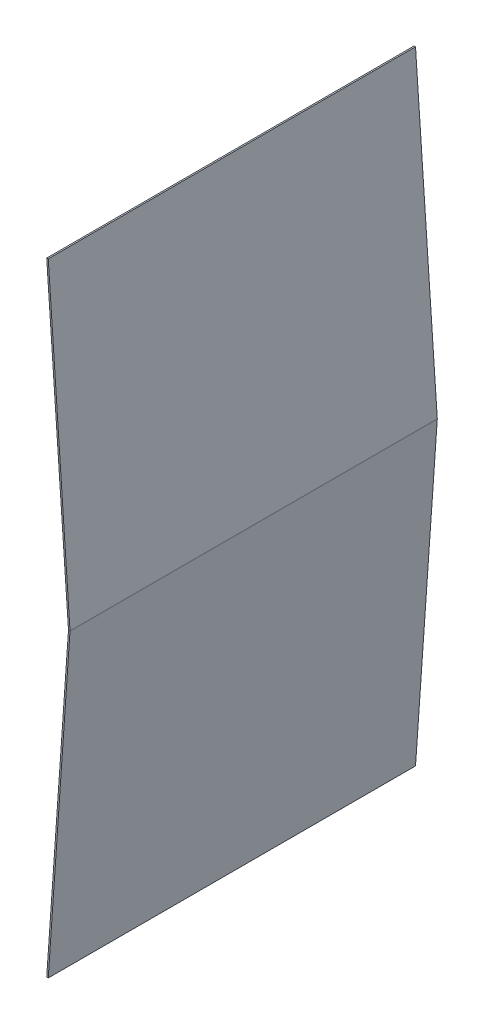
ISO-10303-21;
HEADER;
FILE_DESCRIPTION(('STEP AP214'),'2;1');
FILE_NAME('part.step','',(''),(''),'','','');
FILE_SCHEMA(('AUTOMOTIVE_DESIGN { 1 0 10303 214 1 1 1 1 }'));
ENDSEC;
DATA;
#1=APPLICATION_CONTEXT('core data for automotive mechanical design processes');
#2=APPLICATION_PROTOCOL_DEFINITION('international standard','automotive_design',2000,#1);
#3=PRODUCT_CONTEXT('',#1,'mechanical');
#4=PRODUCT('Part','Part','',(#3));
#5=PRODUCT_RELATED_PRODUCT_CATEGORY('part','',(#4));
#6=PRODUCT_DEFINITION_FORMATION('','',#4);
#7=PRODUCT_DEFINITION_CONTEXT('part definition',#1,'design');
#8=PRODUCT_DEFINITION('design','',#6,#7);
#9=PRODUCT_DEFINITION_SHAPE('','',#8);
#10=(LENGTH_UNIT() NAMED_UNIT(*) SI_UNIT(.MILLI.,.METRE.));
#11=(NAMED_UNIT(*) PLANE_ANGLE_UNIT() SI_UNIT($,.RADIAN.));
#12=(NAMED_UNIT(*) SI_UNIT($,.STERADIAN.) SOLID_ANGLE_UNIT());
#13=UNCERTAINTY_MEASURE_WITH_UNIT(LENGTH_MEASURE(1.E-05),#10,'distance_accuracy_value','');
#14=(GEOMETRIC_REPRESENTATION_CONTEXT(3) GLOBAL_UNCERTAINTY_ASSIGNED_CONTEXT((#13)) GLOBAL_UNIT_ASSIGNED_CONTEXT((#10,
#11,#12)) REPRESENTATION_CONTEXT('',''));
#15=CARTESIAN_POINT('',(0.,0.,0.));
#16=DIRECTION('',(0.,0.,1.));
#17=DIRECTION('',(1.,0.,0.));
#18=AXIS2_PLACEMENT_3D('',#15,#16,#17);
#19=CARTESIAN_POINT('',(90.2992258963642,-0.885907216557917,1524.));
#20=DIRECTION('',(0.,0.,0.999999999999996));
#21=DIRECTION('',(1.00000000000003,0.,0.));
#22=AXIS2_PLACEMENT_3D('',#19,#20,#21);
#23=PLANE('',#22);
#24=DIRECTION('',(-0.997564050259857,0.0697564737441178,0.));
#25=VECTOR('',#24,1.);
#26=CARTESIAN_POINT('',(90.2992258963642,-0.885907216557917,1524.));
#27=LINE('',#26,#25);
#28=CARTESIAN_POINT('',(90.2992258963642,-0.885907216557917,1524.));
#29=VERTEX_POINT('',#28);
#30=CARTESIAN_POINT('',(83.9646941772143,-0.442953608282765,1524.));
#31=VERTEX_POINT('',#30);
#32=EDGE_CURVE('E11',#29,#31,#27,.T.);
#33=ORIENTED_EDGE('',*,*,#32,.F.);
#34=CARTESIAN_POINT('',(77.6301624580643,-7.60512442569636E-12,1524.));
#35=DIRECTION('',(0.,0.,0.999999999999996));
#36=DIRECTION('',(1.00000000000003,0.,0.));
#37=AXIS2_PLACEMENT_3D('',#34,#35,#36);
#38=CIRCLE('',#37,12.7);
#39=CARTESIAN_POINT('',(90.2992258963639,0.885907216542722,1524.));
#40=VERTEX_POINT('',#39);
#41=EDGE_CURVE('E133',#40,#29,#38,.F.);
#42=ORIENTED_EDGE('',*,*,#41,.F.);
#43=DIRECTION('',(0.997564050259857,0.0697564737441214,0.));
#44=VECTOR('',#43,1.);
#45=CARTESIAN_POINT('',(83.9646941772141,0.442953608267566,1524.));
#46=LINE('',#45,#44);
#47=CARTESIAN_POINT('',(83.9646941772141,0.442953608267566,1524.));
#48=VERTEX_POINT('',#47);
#49=EDGE_CURVE('E44',#48,#40,#46,.T.);
#50=ORIENTED_EDGE('',*,*,#49,.F.);
#51=CARTESIAN_POINT('',(77.6301624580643,-7.60512442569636E-12,1524.));
#52=DIRECTION('',(0.,0.,0.999999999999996));
#53=DIRECTION('',(1.00000000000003,0.,0.));
#54=AXIS2_PLACEMENT_3D('',#51,#52,#53);
#55=CIRCLE('',#54,6.35);
#56=EDGE_CURVE('E126',#48,#31,#55,.F.);
#57=ORIENTED_EDGE('',*,*,#56,.T.);
#58=EDGE_LOOP('',(#33,#42,#50,#57));
#59=FACE_BOUND('',#58,.T.);
#60=ADVANCED_FACE('F36',(#59),#23,.T.);
#61=CARTESIAN_POINT('',(83.9646941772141,0.442953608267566,1524.));
#62=DIRECTION('',(0.,0.,0.999999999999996));
#63=DIRECTION('',(1.00000000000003,0.,0.));
#64=AXIS2_PLACEMENT_3D('',#61,#62,#63);
#65=PLANE('',#64);
#66=DIRECTION('',(-0.0697564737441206,-0.997564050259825,0.));
#67=VECTOR('',#66,1.);
#68=CARTESIAN_POINT('',(90.3611745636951,-1.00748044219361E-11,1524.));
#69=LINE('',#68,#67);
#70=CARTESIAN_POINT('',(6.10622663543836E-13,-1292.22500000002,1524.));
#71=VERTEX_POINT('',#70);
#72=EDGE_CURVE('E182',#29,#71,#69,.T.);
#73=ORIENTED_EDGE('',*,*,#72,.F.);
#74=ORIENTED_EDGE('',*,*,#32,.T.);
#75=DIRECTION('',(-0.0697564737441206,-0.997564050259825,0.));
#76=VECTOR('',#75,1.);
#77=CARTESIAN_POINT('',(84.0266428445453,0.442953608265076,1524.));
#78=LINE('',#77,#76);
#79=CARTESIAN_POINT('',(-6.33453171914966,-1291.78204639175,1524.));
#80=VERTEX_POINT('',#79);
#81=EDGE_CURVE('E92',#31,#80,#78,.T.);
#82=ORIENTED_EDGE('',*,*,#81,.T.);
#83=DIRECTION('',(-0.99756405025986,0.0697564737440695,0.));
#84=VECTOR('',#83,1.);
#85=CARTESIAN_POINT('',(6.10622663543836E-13,-1292.22500000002,1524.));
#86=LINE('',#85,#84);
#87=EDGE_CURVE('E339',#71,#80,#86,.T.);
#88=ORIENTED_EDGE('',*,*,#87,.F.);
#89=EDGE_LOOP('',(#73,#74,#82,#88));
#90=FACE_BOUND('',#89,.T.);
#91=ADVANCED_FACE('F190',(#90),#65,.T.);
#92=CARTESIAN_POINT('',(90.2992258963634,0.88590721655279,0.));
#93=DIRECTION('',(0.,0.,-0.999999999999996));
#94=DIRECTION('',(-1.00000000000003,0.,0.));
#95=AXIS2_PLACEMENT_3D('',#92,#93,#94);
#96=PLANE('',#95);
#97=DIRECTION('',(-0.997564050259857,-0.0697564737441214,0.));
#98=VECTOR('',#97,1.);
#99=CARTESIAN_POINT('',(90.2992258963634,0.88590721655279,0.));
#100=LINE('',#99,#98);
#101=CARTESIAN_POINT('',(90.2992258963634,0.88590721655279,0.));
#102=VERTEX_POINT('',#101);
#103=CARTESIAN_POINT('',(83.9646941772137,0.442953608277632,0.));
#104=VERTEX_POINT('',#103);
#105=EDGE_CURVE('E79',#102,#104,#100,.T.);
#106=ORIENTED_EDGE('',*,*,#105,.F.);
#107=CARTESIAN_POINT('',(77.6301624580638,2.46215591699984E-12,0.));
#108=DIRECTION('',(0.,0.,0.999999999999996));
#109=DIRECTION('',(1.00000000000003,0.,0.));
#110=AXIS2_PLACEMENT_3D('',#107,#108,#109);
#111=CIRCLE('',#110,12.7);
#112=CARTESIAN_POINT('',(90.2992258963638,-0.885907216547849,0.));
#113=VERTEX_POINT('',#112);
#114=EDGE_CURVE('E148',#102,#113,#111,.F.);
#115=ORIENTED_EDGE('',*,*,#114,.T.);
#116=DIRECTION('',(0.997564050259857,-0.0697564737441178,0.));
#117=VECTOR('',#116,1.);
#118=CARTESIAN_POINT('',(83.9646941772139,-0.442953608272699,0.));
#119=LINE('',#118,#117);
#120=CARTESIAN_POINT('',(83.9646941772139,-0.442953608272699,0.));
#121=VERTEX_POINT('',#120);
#122=EDGE_CURVE('E86',#121,#113,#119,.T.);
#123=ORIENTED_EDGE('',*,*,#122,.F.);
#124=CARTESIAN_POINT('',(77.6301624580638,2.46215591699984E-12,0.));
#125=DIRECTION('',(0.,0.,0.999999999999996));
#126=DIRECTION('',(1.00000000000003,0.,0.));
#127=AXIS2_PLACEMENT_3D('',#124,#125,#126);
#128=CIRCLE('',#127,6.35);
#129=EDGE_CURVE('E155',#104,#121,#128,.F.);
#130=ORIENTED_EDGE('',*,*,#129,.F.);
#131=EDGE_LOOP('',(#106,#115,#123,#130));
#132=FACE_BOUND('',#131,.T.);
#133=ADVANCED_FACE('F188',(#132),#96,.T.);
#134=CARTESIAN_POINT('',(83.9646941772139,-0.442953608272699,0.));
#135=DIRECTION('',(0.,0.,-0.999999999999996));
#136=DIRECTION('',(-1.00000000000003,0.,0.));
#137=AXIS2_PLACEMENT_3D('',#134,#135,#136);
#138=PLANE('',#137);
#139=DIRECTION('',(0.06975647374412,-0.997564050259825,0.));
#140=VECTOR('',#139,1.);
#141=CARTESIAN_POINT('',(-1.11022302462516E-12,1292.22499999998,0.));
#142=LINE('',#141,#140);
#143=CARTESIAN_POINT('',(-1.11022302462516E-12,1292.22499999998,0.));
#144=VERTEX_POINT('',#143);
#145=EDGE_CURVE('E150',#144,#102,#142,.T.);
#146=ORIENTED_EDGE('',*,*,#145,.T.);
#147=ORIENTED_EDGE('',*,*,#105,.T.);
#148=DIRECTION('',(0.06975647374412,-0.997564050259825,0.));
#149=VECTOR('',#148,1.);
#150=CARTESIAN_POINT('',(-6.33453171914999,1291.78204639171,0.));
#151=LINE('',#150,#149);
#152=CARTESIAN_POINT('',(-6.33453171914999,1291.78204639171,0.));
#153=VERTEX_POINT('',#152);
#154=EDGE_CURVE('E153',#153,#104,#151,.T.);
#155=ORIENTED_EDGE('',*,*,#154,.F.);
#156=DIRECTION('',(0.997564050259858,0.0697564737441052,0.));
#157=VECTOR('',#156,1.);
#158=CARTESIAN_POINT('',(-6.33453171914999,1291.78204639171,0.));
#159=LINE('',#158,#157);
#160=EDGE_CURVE('E114',#153,#144,#159,.T.);
#161=ORIENTED_EDGE('',*,*,#160,.T.);
#162=EDGE_LOOP('',(#146,#147,#155,#161));
#163=FACE_BOUND('',#162,.T.);
#164=ADVANCED_FACE('F184',(#163),#138,.T.);
#165=CARTESIAN_POINT('',(84.0266428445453,0.442953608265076,1524.));
#166=DIRECTION('',(0.997564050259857,-0.0697564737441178,0.));
#167=DIRECTION('',(0.0697564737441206,0.997564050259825,0.));
#168=AXIS2_PLACEMENT_3D('',#165,#166,#167);
#169=PLANE('',#168);
#170=DIRECTION('',(-0.0697564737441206,-0.997564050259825,0.));
#171=VECTOR('',#170,1.);
#172=CARTESIAN_POINT('',(84.0266428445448,0.442953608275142,0.));
#173=LINE('',#172,#171);
#174=CARTESIAN_POINT('',(-6.33453171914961,-1291.78204639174,1.77635683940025E-12));
#175=VERTEX_POINT('',#174);
#176=EDGE_CURVE('E139',#121,#175,#173,.T.);
#177=ORIENTED_EDGE('',*,*,#176,.T.);
#178=DIRECTION('',(0.,0.,-0.999999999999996));
#179=VECTOR('',#178,1.);
#180=CARTESIAN_POINT('',(-6.33453171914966,-1291.78204639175,1524.));
#181=LINE('',#180,#179);
#182=EDGE_CURVE('E169',#80,#175,#181,.T.);
#183=ORIENTED_EDGE('',*,*,#182,.F.);
#184=ORIENTED_EDGE('',*,*,#81,.F.);
#185=DIRECTION('',(0.,0.,-0.999999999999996));
#186=VECTOR('',#185,1.);
#187=CARTESIAN_POINT('',(83.9646941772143,-0.442953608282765,1524.));
#188=LINE('',#187,#186);
#189=EDGE_CURVE('E138',#31,#121,#188,.T.);
#190=ORIENTED_EDGE('',*,*,#189,.T.);
#191=EDGE_LOOP('',(#177,#183,#184,#190));
#192=FACE_BOUND('',#191,.T.);
#193=ADVANCED_FACE('F196',(#192),#169,.F.);
#194=CARTESIAN_POINT('',(6.10622663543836E-13,-1292.22500000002,1524.));
#195=DIRECTION('',(-0.0697564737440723,-0.997564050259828,0.));
#196=DIRECTION('',(0.99756405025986,-0.0697564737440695,0.));
#197=AXIS2_PLACEMENT_3D('',#194,#195,#196);
#198=PLANE('',#197);
#199=DIRECTION('',(-0.99756405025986,0.0697564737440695,0.));
#200=VECTOR('',#199,1.);
#201=CARTESIAN_POINT('',(1.27675647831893E-12,-1292.22500000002,3.5527136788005E-12));
#202=LINE('',#201,#200);
#203=CARTESIAN_POINT('',(1.27675647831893E-12,-1292.22500000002,3.5527136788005E-12));
#204=VERTEX_POINT('',#203);
#205=EDGE_CURVE('E142',#204,#175,#202,.T.);
#206=ORIENTED_EDGE('',*,*,#205,.F.);
#207=DIRECTION('',(0.,0.,-0.999999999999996));
#208=VECTOR('',#207,1.);
#209=CARTESIAN_POINT('',(6.10622663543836E-13,-1292.22500000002,1524.));
#210=LINE('',#209,#208);
#211=EDGE_CURVE('E167',#71,#204,#210,.T.);
#212=ORIENTED_EDGE('',*,*,#211,.F.);
#213=ORIENTED_EDGE('',*,*,#87,.T.);
#214=ORIENTED_EDGE('',*,*,#182,.T.);
#215=EDGE_LOOP('',(#206,#212,#213,#214));
#216=FACE_BOUND('',#215,.T.);
#217=ADVANCED_FACE('F227',(#216),#198,.T.);
#218=CARTESIAN_POINT('',(90.3611745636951,-1.00748044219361E-11,1524.));
#219=DIRECTION('',(0.997564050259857,-0.0697564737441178,0.));
#220=DIRECTION('',(0.0697564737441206,0.997564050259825,0.));
#221=AXIS2_PLACEMENT_3D('',#218,#219,#220);
#222=PLANE('',#221);
#223=DIRECTION('',(-0.0697564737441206,-0.997564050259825,0.));
#224=VECTOR('',#223,1.);
#225=CARTESIAN_POINT('',(90.3611745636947,0.,0.));
#226=LINE('',#225,#224);
#227=EDGE_CURVE('E145',#113,#204,#226,.T.);
#228=ORIENTED_EDGE('',*,*,#227,.F.);
#229=DIRECTION('',(0.,0.,-0.999999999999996));
#230=VECTOR('',#229,1.);
#231=CARTESIAN_POINT('',(90.2992258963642,-0.885907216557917,1524.));
#232=LINE('',#231,#230);
#233=EDGE_CURVE('E164',#29,#113,#232,.T.);
#234=ORIENTED_EDGE('',*,*,#233,.F.);
#235=ORIENTED_EDGE('',*,*,#72,.T.);
#236=ORIENTED_EDGE('',*,*,#211,.T.);
#237=EDGE_LOOP('',(#228,#234,#235,#236));
#238=FACE_BOUND('',#237,.T.);
#239=ADVANCED_FACE('F238',(#238),#222,.T.);
#240=CARTESIAN_POINT('',(77.6301624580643,-7.60512442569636E-12,1524.));
#241=DIRECTION('',(0.,0.,-0.999999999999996));
#242=DIRECTION('',(-1.00000000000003,0.,0.));
#243=AXIS2_PLACEMENT_3D('',#240,#241,#242);
#244=CYLINDRICAL_SURFACE('',#243,12.7);
#245=ORIENTED_EDGE('',*,*,#114,.F.);
#246=DIRECTION('',(0.,0.,-0.999999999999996));
#247=VECTOR('',#246,1.);
#248=CARTESIAN_POINT('',(90.2992258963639,0.885907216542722,1524.));
#249=LINE('',#248,#247);
#250=EDGE_CURVE('E161',#40,#102,#249,.T.);
#251=ORIENTED_EDGE('',*,*,#250,.F.);
#252=ORIENTED_EDGE('',*,*,#41,.T.);
#253=ORIENTED_EDGE('',*,*,#233,.T.);
#254=EDGE_LOOP('',(#245,#251,#252,#253));
#255=FACE_BOUND('',#254,.T.);
#256=ADVANCED_FACE('F178',(#255),#244,.T.);
#257=CARTESIAN_POINT('',(8.88178419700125E-13,1292.22499999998,1524.));
#258=DIRECTION('',(0.997564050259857,0.0697564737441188,0.));
#259=DIRECTION('',(-0.06975647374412,0.997564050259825,0.));
#260=AXIS2_PLACEMENT_3D('',#257,#258,#259);
#261=PLANE('',#260);
#262=ORIENTED_EDGE('',*,*,#145,.F.);
#263=DIRECTION('',(0.,0.,-0.999999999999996));
#264=VECTOR('',#263,1.);
#265=CARTESIAN_POINT('',(8.88178419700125E-13,1292.22499999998,1524.));
#266=LINE('',#265,#264);
#267=CARTESIAN_POINT('',(8.88178419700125E-13,1292.22499999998,1524.));
#268=VERTEX_POINT('',#267);
#269=EDGE_CURVE('E116',#268,#144,#266,.T.);
#270=ORIENTED_EDGE('',*,*,#269,.F.);
#271=DIRECTION('',(0.06975647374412,-0.997564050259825,0.));
#272=VECTOR('',#271,1.);
#273=CARTESIAN_POINT('',(8.88178419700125E-13,1292.22499999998,1524.));
#274=LINE('',#273,#272);
#275=EDGE_CURVE('E131',#268,#40,#274,.T.);
#276=ORIENTED_EDGE('',*,*,#275,.T.);
#277=ORIENTED_EDGE('',*,*,#250,.T.);
#278=EDGE_LOOP('',(#262,#270,#276,#277));
#279=FACE_BOUND('',#278,.T.);
#280=ADVANCED_FACE('F183',(#279),#261,.T.);
#281=CARTESIAN_POINT('',(-6.33453171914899,1291.78204639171,1524.));
#282=DIRECTION('',(-0.0697564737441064,0.997564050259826,0.));
#283=DIRECTION('',(-0.997564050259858,-0.0697564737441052,0.));
#284=AXIS2_PLACEMENT_3D('',#281,#282,#283);
#285=PLANE('',#284);
#286=ORIENTED_EDGE('',*,*,#160,.F.);
#287=DIRECTION('',(0.,0.,-0.999999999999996));
#288=VECTOR('',#287,1.);
#289=CARTESIAN_POINT('',(-6.33453171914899,1291.78204639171,1524.));
#290=LINE('',#289,#288);
#291=CARTESIAN_POINT('',(-6.33453171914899,1291.78204639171,1524.));
#292=VERTEX_POINT('',#291);
#293=EDGE_CURVE('E108',#292,#153,#290,.T.);
#294=ORIENTED_EDGE('',*,*,#293,.F.);
#295=DIRECTION('',(0.997564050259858,0.0697564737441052,0.));
#296=VECTOR('',#295,1.);
#297=CARTESIAN_POINT('',(-6.33453171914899,1291.78204639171,1524.));
#298=LINE('',#297,#296);
#299=EDGE_CURVE('E112',#292,#268,#298,.T.);
#300=ORIENTED_EDGE('',*,*,#299,.T.);
#301=ORIENTED_EDGE('',*,*,#269,.T.);
#302=EDGE_LOOP('',(#286,#294,#300,#301));
#303=FACE_BOUND('',#302,.T.);
#304=ADVANCED_FACE('F110',(#303),#285,.T.);
#305=CARTESIAN_POINT('',(-6.33453171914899,1291.78204639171,1524.));
#306=DIRECTION('',(0.997564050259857,0.0697564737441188,0.));
#307=DIRECTION('',(-0.06975647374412,0.997564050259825,0.));
#308=AXIS2_PLACEMENT_3D('',#305,#306,#307);
#309=PLANE('',#308);
#310=ORIENTED_EDGE('',*,*,#154,.T.);
#311=DIRECTION('',(0.,0.,-0.999999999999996));
#312=VECTOR('',#311,1.);
#313=CARTESIAN_POINT('',(83.9646941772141,0.442953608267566,1524.));
#314=LINE('',#313,#312);
#315=EDGE_CURVE('E117',#48,#104,#314,.T.);
#316=ORIENTED_EDGE('',*,*,#315,.F.);
#317=DIRECTION('',(0.06975647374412,-0.997564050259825,0.));
#318=VECTOR('',#317,1.);
#319=CARTESIAN_POINT('',(-6.33453171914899,1291.78204639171,1524.));
#320=LINE('',#319,#318);
#321=EDGE_CURVE('E121',#292,#48,#320,.T.);
#322=ORIENTED_EDGE('',*,*,#321,.F.);
#323=ORIENTED_EDGE('',*,*,#293,.T.);
#324=EDGE_LOOP('',(#310,#316,#322,#323));
#325=FACE_BOUND('',#324,.T.);
#326=ADVANCED_FACE('F122',(#325),#309,.F.);
#327=CARTESIAN_POINT('',(77.6301624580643,-7.60512442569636E-12,1524.));
#328=DIRECTION('',(0.,0.,-0.999999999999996));
#329=DIRECTION('',(-1.00000000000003,0.,0.));
#330=AXIS2_PLACEMENT_3D('',#327,#328,#329);
#331=CYLINDRICAL_SURFACE('',#330,6.35);
#332=ORIENTED_EDGE('',*,*,#129,.T.);
#333=ORIENTED_EDGE('',*,*,#189,.F.);
#334=ORIENTED_EDGE('',*,*,#56,.F.);
#335=ORIENTED_EDGE('',*,*,#315,.T.);
#336=EDGE_LOOP('',(#332,#333,#334,#335));
#337=FACE_BOUND('',#336,.T.);
#338=ADVANCED_FACE('F186',(#337),#331,.F.);
#339=CARTESIAN_POINT('',(77.6301624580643,-7.60512442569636E-12,1524.));
#340=DIRECTION('',(0.,0.,0.999999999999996));
#341=DIRECTION('',(1.00000000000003,0.,0.));
#342=AXIS2_PLACEMENT_3D('',#339,#340,#341);
#343=PLANE('',#342);
#344=ORIENTED_EDGE('',*,*,#321,.T.);
#345=ORIENTED_EDGE('',*,*,#49,.T.);
#346=ORIENTED_EDGE('',*,*,#275,.F.);
#347=ORIENTED_EDGE('',*,*,#299,.F.);
#348=EDGE_LOOP('',(#344,#345,#346,#347));
#349=FACE_BOUND('',#348,.T.);
#350=ADVANCED_FACE('F129',(#349),#343,.T.);
#351=CARTESIAN_POINT('',(77.6301624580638,2.46215591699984E-12,0.));
#352=DIRECTION('',(0.,0.,0.999999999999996));
#353=DIRECTION('',(1.00000000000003,0.,0.));
#354=AXIS2_PLACEMENT_3D('',#351,#352,#353);
#355=PLANE('',#354);
#356=ORIENTED_EDGE('',*,*,#176,.F.);
#357=ORIENTED_EDGE('',*,*,#122,.T.);
#358=ORIENTED_EDGE('',*,*,#227,.T.);
#359=ORIENTED_EDGE('',*,*,#205,.T.);
#360=EDGE_LOOP('',(#356,#357,#358,#359));
#361=FACE_BOUND('',#360,.T.);
#362=ADVANCED_FACE('F304',(#361),#355,.F.);
#363=CLOSED_SHELL('',(#60,#91,#133,#164,#193,#217,#239,#256,#280,#304,#326,#338,#350,#362));
#364=MANIFOLD_SOLID_BREP('B2',#363);
#365=ADVANCED_BREP_SHAPE_REPRESENTATION('',(#18,#364),#14);
#366=SHAPE_DEFINITION_REPRESENTATION(#9,#365);
ENDSEC;
END-ISO-10303-21;
